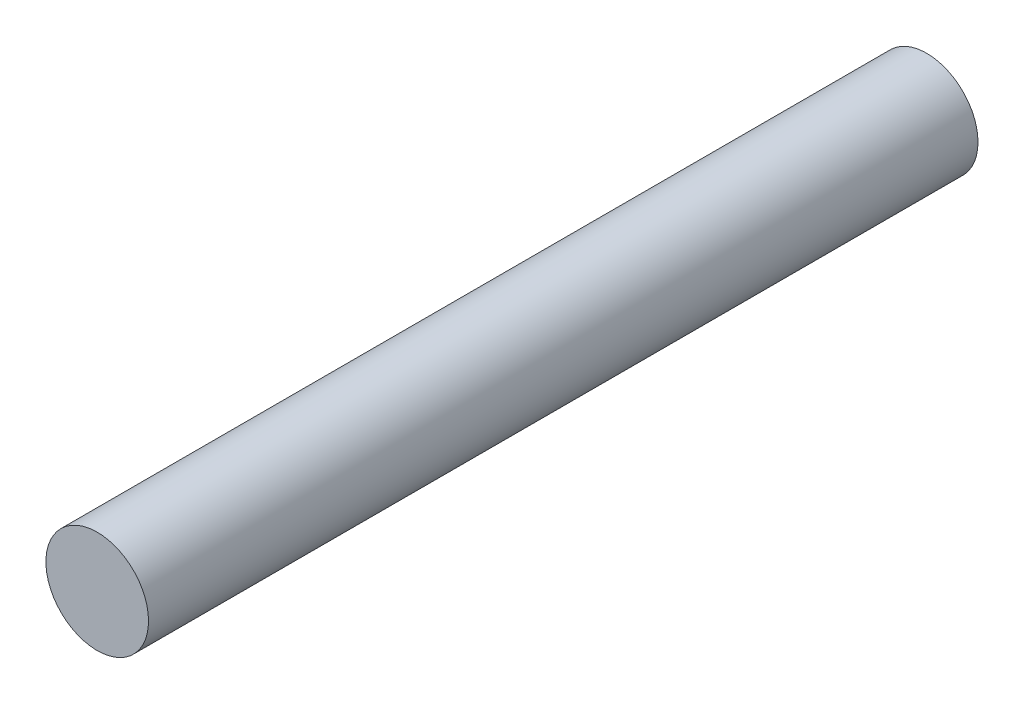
from build123d import *

# Parameters (mm, degrees)
SKETCH1_R      = 6
EXTRUDE1_DEPTH = 97


with BuildPart() as part:
    # Sketch1 → Extrude1 (new body)
    with BuildSketch(Plane.XY):
        Circle(SKETCH1_R)
    extrude(amount=EXTRUDE1_DEPTH)


solid = part.part
